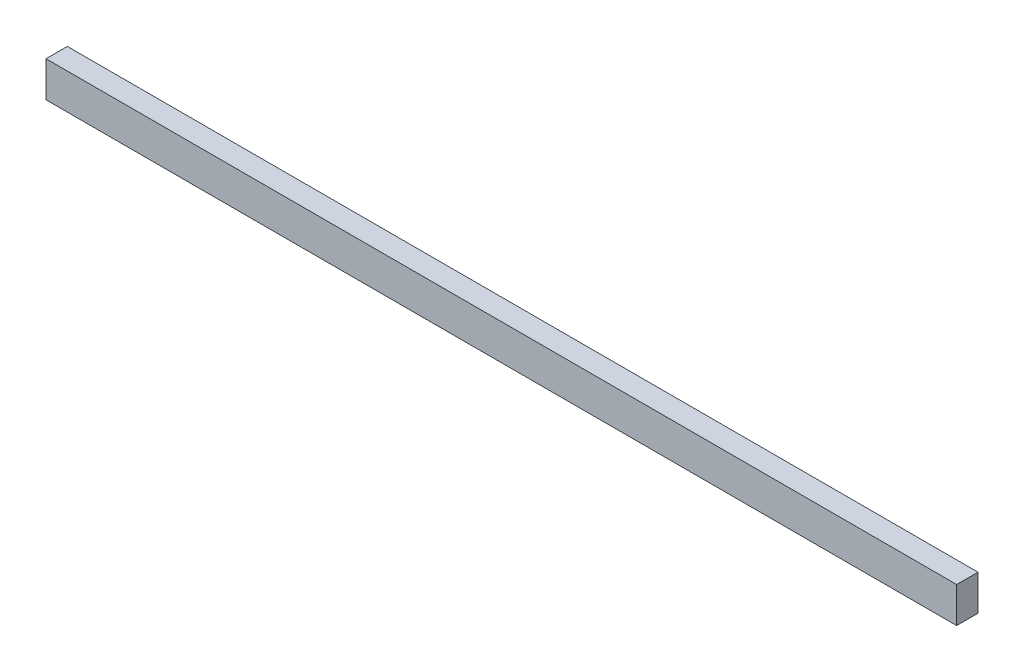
ISO-10303-21;
HEADER;
FILE_DESCRIPTION(('STEP AP214'),'2;1');
FILE_NAME('part.step','',(''),(''),'','','');
FILE_SCHEMA(('AUTOMOTIVE_DESIGN { 1 0 10303 214 1 1 1 1 }'));
ENDSEC;
DATA;
#1=APPLICATION_CONTEXT('core data for automotive mechanical design processes');
#2=APPLICATION_PROTOCOL_DEFINITION('international standard','automotive_design',2000,#1);
#3=PRODUCT_CONTEXT('',#1,'mechanical');
#4=PRODUCT('Part','Part','',(#3));
#5=PRODUCT_RELATED_PRODUCT_CATEGORY('part','',(#4));
#6=PRODUCT_DEFINITION_FORMATION('','',#4);
#7=PRODUCT_DEFINITION_CONTEXT('part definition',#1,'design');
#8=PRODUCT_DEFINITION('design','',#6,#7);
#9=PRODUCT_DEFINITION_SHAPE('','',#8);
#10=(LENGTH_UNIT() NAMED_UNIT(*) SI_UNIT(.MILLI.,.METRE.));
#11=(NAMED_UNIT(*) PLANE_ANGLE_UNIT() SI_UNIT($,.RADIAN.));
#12=(NAMED_UNIT(*) SI_UNIT($,.STERADIAN.) SOLID_ANGLE_UNIT());
#13=UNCERTAINTY_MEASURE_WITH_UNIT(LENGTH_MEASURE(1.E-05),#10,'distance_accuracy_value','');
#14=(GEOMETRIC_REPRESENTATION_CONTEXT(3) GLOBAL_UNCERTAINTY_ASSIGNED_CONTEXT((#13)) GLOBAL_UNIT_ASSIGNED_CONTEXT((#10,
#11,#12)) REPRESENTATION_CONTEXT('',''));
#15=CARTESIAN_POINT('',(0.,0.,0.));
#16=DIRECTION('',(0.,0.,1.));
#17=DIRECTION('',(1.,0.,0.));
#18=AXIS2_PLACEMENT_3D('',#15,#16,#17);
#19=CARTESIAN_POINT('',(1625.6,-31.75,38.1));
#20=DIRECTION('',(0.,1.,0.));
#21=DIRECTION('',(0.,0.,1.));
#22=AXIS2_PLACEMENT_3D('',#19,#20,#21);
#23=PLANE('',#22);
#24=DIRECTION('',(0.,0.,-1.));
#25=VECTOR('',#24,1.);
#26=CARTESIAN_POINT('',(0.,-31.75,38.1));
#27=LINE('',#26,#25);
#28=CARTESIAN_POINT('',(0.,-31.75,38.1));
#29=VERTEX_POINT('',#28);
#30=CARTESIAN_POINT('',(0.,-31.75,0.));
#31=VERTEX_POINT('',#30);
#32=EDGE_CURVE('E115',#29,#31,#27,.T.);
#33=ORIENTED_EDGE('',*,*,#32,.T.);
#34=DIRECTION('',(-1.,0.,0.));
#35=VECTOR('',#34,1.);
#36=CARTESIAN_POINT('',(1625.6,-31.75,0.));
#37=LINE('',#36,#35);
#38=CARTESIAN_POINT('',(1625.6,-31.75,0.));
#39=VERTEX_POINT('',#38);
#40=EDGE_CURVE('E11',#39,#31,#37,.T.);
#41=ORIENTED_EDGE('',*,*,#40,.F.);
#42=DIRECTION('',(0.,0.,-1.));
#43=VECTOR('',#42,1.);
#44=CARTESIAN_POINT('',(1625.6,-31.75,38.1));
#45=LINE('',#44,#43);
#46=CARTESIAN_POINT('',(1625.6,-31.75,38.1));
#47=VERTEX_POINT('',#46);
#48=EDGE_CURVE('E92',#47,#39,#45,.T.);
#49=ORIENTED_EDGE('',*,*,#48,.F.);
#50=DIRECTION('',(-1.,0.,0.));
#51=VECTOR('',#50,1.);
#52=CARTESIAN_POINT('',(1625.6,-31.75,38.1));
#53=LINE('',#52,#51);
#54=EDGE_CURVE('E107',#47,#29,#53,.T.);
#55=ORIENTED_EDGE('',*,*,#54,.T.);
#56=EDGE_LOOP('',(#33,#41,#49,#55));
#57=FACE_BOUND('',#56,.T.);
#58=ADVANCED_FACE('F43',(#57),#23,.F.);
#59=CARTESIAN_POINT('',(1625.6,-31.75,0.));
#60=DIRECTION('',(0.,0.,1.));
#61=DIRECTION('',(1.,0.,0.));
#62=AXIS2_PLACEMENT_3D('',#59,#60,#61);
#63=PLANE('',#62);
#64=DIRECTION('',(0.,1.,0.));
#65=VECTOR('',#64,1.);
#66=CARTESIAN_POINT('',(0.,-31.75,0.));
#67=LINE('',#66,#65);
#68=CARTESIAN_POINT('',(0.,31.75,0.));
#69=VERTEX_POINT('',#68);
#70=EDGE_CURVE('E99',#31,#69,#67,.T.);
#71=ORIENTED_EDGE('',*,*,#70,.T.);
#72=DIRECTION('',(-1.,0.,0.));
#73=VECTOR('',#72,1.);
#74=CARTESIAN_POINT('',(1625.6,31.75,0.));
#75=LINE('',#74,#73);
#76=CARTESIAN_POINT('',(1625.6,31.75,0.));
#77=VERTEX_POINT('',#76);
#78=EDGE_CURVE('E55',#77,#69,#75,.T.);
#79=ORIENTED_EDGE('',*,*,#78,.F.);
#80=DIRECTION('',(0.,1.,0.));
#81=VECTOR('',#80,1.);
#82=CARTESIAN_POINT('',(1625.6,-31.75,0.));
#83=LINE('',#82,#81);
#84=EDGE_CURVE('E89',#39,#77,#83,.T.);
#85=ORIENTED_EDGE('',*,*,#84,.F.);
#86=ORIENTED_EDGE('',*,*,#40,.T.);
#87=EDGE_LOOP('',(#71,#79,#85,#86));
#88=FACE_BOUND('',#87,.T.);
#89=ADVANCED_FACE('F97',(#88),#63,.F.);
#90=CARTESIAN_POINT('',(1625.6,31.75,0.));
#91=DIRECTION('',(0.,-1.,0.));
#92=DIRECTION('',(0.,0.,-1.));
#93=AXIS2_PLACEMENT_3D('',#90,#91,#92);
#94=PLANE('',#93);
#95=DIRECTION('',(0.,0.,1.));
#96=VECTOR('',#95,1.);
#97=CARTESIAN_POINT('',(0.,31.75,0.));
#98=LINE('',#97,#96);
#99=CARTESIAN_POINT('',(0.,31.75,38.1));
#100=VERTEX_POINT('',#99);
#101=EDGE_CURVE('E80',#69,#100,#98,.T.);
#102=ORIENTED_EDGE('',*,*,#101,.T.);
#103=DIRECTION('',(-1.,0.,0.));
#104=VECTOR('',#103,1.);
#105=CARTESIAN_POINT('',(1625.6,31.75,38.1));
#106=LINE('',#105,#104);
#107=CARTESIAN_POINT('',(1625.6,31.75,38.1));
#108=VERTEX_POINT('',#107);
#109=EDGE_CURVE('E105',#108,#100,#106,.T.);
#110=ORIENTED_EDGE('',*,*,#109,.F.);
#111=DIRECTION('',(0.,0.,1.));
#112=VECTOR('',#111,1.);
#113=CARTESIAN_POINT('',(1625.6,31.75,0.));
#114=LINE('',#113,#112);
#115=EDGE_CURVE('E91',#77,#108,#114,.T.);
#116=ORIENTED_EDGE('',*,*,#115,.F.);
#117=ORIENTED_EDGE('',*,*,#78,.T.);
#118=EDGE_LOOP('',(#102,#110,#116,#117));
#119=FACE_BOUND('',#118,.T.);
#120=ADVANCED_FACE('F103',(#119),#94,.F.);
#121=CARTESIAN_POINT('',(1625.6,31.75,38.1));
#122=DIRECTION('',(0.,0.,-1.));
#123=DIRECTION('',(-1.,0.,0.));
#124=AXIS2_PLACEMENT_3D('',#121,#122,#123);
#125=PLANE('',#124);
#126=DIRECTION('',(0.,-1.,0.));
#127=VECTOR('',#126,1.);
#128=CARTESIAN_POINT('',(0.,31.75,38.1));
#129=LINE('',#128,#127);
#130=EDGE_CURVE('E83',#100,#29,#129,.T.);
#131=ORIENTED_EDGE('',*,*,#130,.T.);
#132=ORIENTED_EDGE('',*,*,#54,.F.);
#133=DIRECTION('',(0.,-1.,0.));
#134=VECTOR('',#133,1.);
#135=CARTESIAN_POINT('',(1625.6,31.75,38.1));
#136=LINE('',#135,#134);
#137=EDGE_CURVE('E58',#108,#47,#136,.T.);
#138=ORIENTED_EDGE('',*,*,#137,.F.);
#139=ORIENTED_EDGE('',*,*,#109,.T.);
#140=EDGE_LOOP('',(#131,#132,#138,#139));
#141=FACE_BOUND('',#140,.T.);
#142=ADVANCED_FACE('F127',(#141),#125,.F.);
#143=CARTESIAN_POINT('',(1625.6,0.,0.));
#144=DIRECTION('',(1.,0.,0.));
#145=DIRECTION('',(0.,0.,-1.));
#146=AXIS2_PLACEMENT_3D('',#143,#144,#145);
#147=PLANE('',#146);
#148=ORIENTED_EDGE('',*,*,#48,.T.);
#149=ORIENTED_EDGE('',*,*,#84,.T.);
#150=ORIENTED_EDGE('',*,*,#115,.T.);
#151=ORIENTED_EDGE('',*,*,#137,.T.);
#152=EDGE_LOOP('',(#148,#149,#150,#151));
#153=FACE_BOUND('',#152,.T.);
#154=ADVANCED_FACE('F93',(#153),#147,.T.);
#155=CARTESIAN_POINT('',(0.,0.,0.));
#156=DIRECTION('',(1.,0.,0.));
#157=DIRECTION('',(0.,0.,-1.));
#158=AXIS2_PLACEMENT_3D('',#155,#156,#157);
#159=PLANE('',#158);
#160=ORIENTED_EDGE('',*,*,#32,.F.);
#161=ORIENTED_EDGE('',*,*,#130,.F.);
#162=ORIENTED_EDGE('',*,*,#101,.F.);
#163=ORIENTED_EDGE('',*,*,#70,.F.);
#164=EDGE_LOOP('',(#160,#161,#162,#163));
#165=FACE_BOUND('',#164,.T.);
#166=ADVANCED_FACE('F129',(#165),#159,.F.);
#167=CLOSED_SHELL('',(#58,#89,#120,#142,#154,#166));
#168=MANIFOLD_SOLID_BREP('B2',#167);
#169=ADVANCED_BREP_SHAPE_REPRESENTATION('',(#18,#168),#14);
#170=SHAPE_DEFINITION_REPRESENTATION(#9,#169);
ENDSEC;
END-ISO-10303-21;
